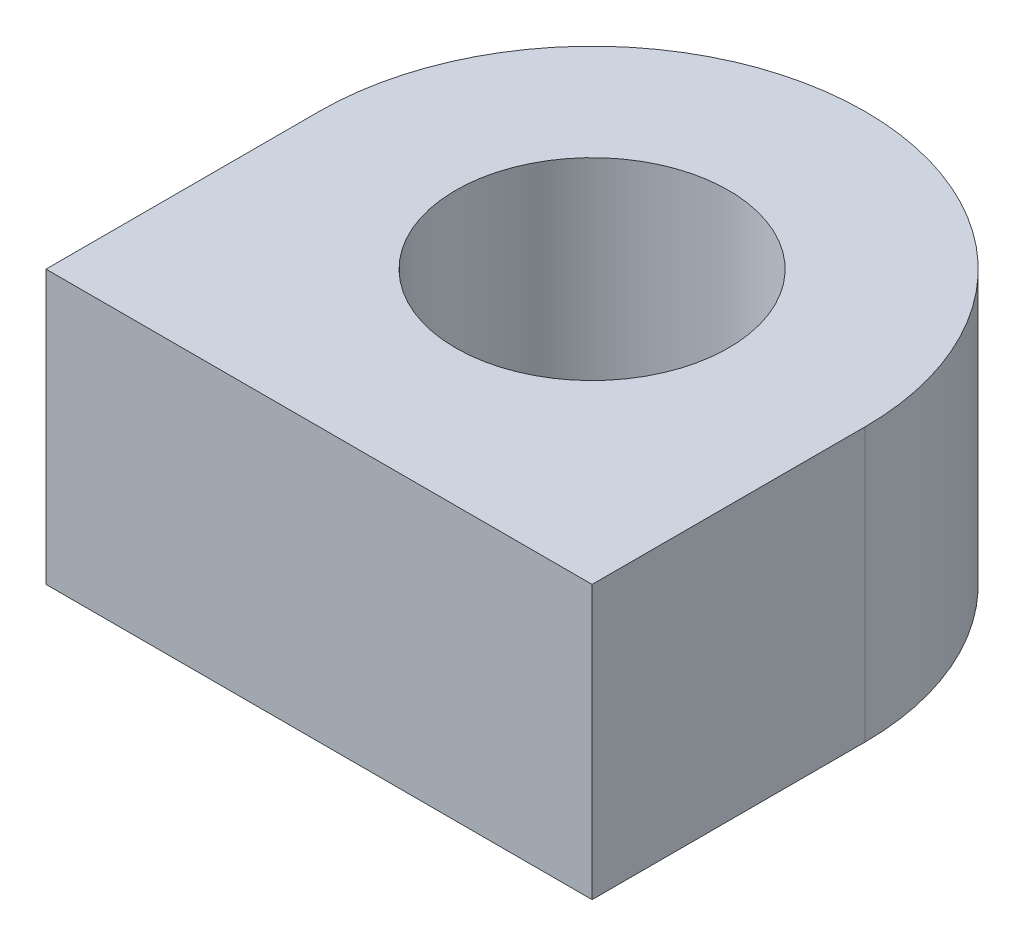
from build123d import *

# Parameters (mm, degrees)
SKETCH1_R           = 0.79375
BOSS_EXTRUDE1_DEPTH = 1.5875


with BuildPart() as part:
    # Sketch1 → Boss-Extrude1 (new body)
    with BuildSketch(Plane(origin=(0, 0, 0), x_dir=(1, 0, 0), z_dir=(0, 1, 0))):
        with BuildLine():
            Line((-1.5875, 0), (-1.5875, -1.5875))
            Line((-1.5875, -1.5875), (0, -1.5875))
            Line((0, -1.5875), (1.5875, -1.5875))
            Line((1.5875, -1.5875), (1.5875, 0))
            ThreePointArc((1.5875, 0), (0, 1.5875), (-1.5875, 0))
        make_face()
        with Locations(Location((0, 0, 0), (0, 0, 270))):
            Circle(SKETCH1_R, mode=Mode.SUBTRACT)
    extrude(amount=BOSS_EXTRUDE1_DEPTH)


solid = part.part
